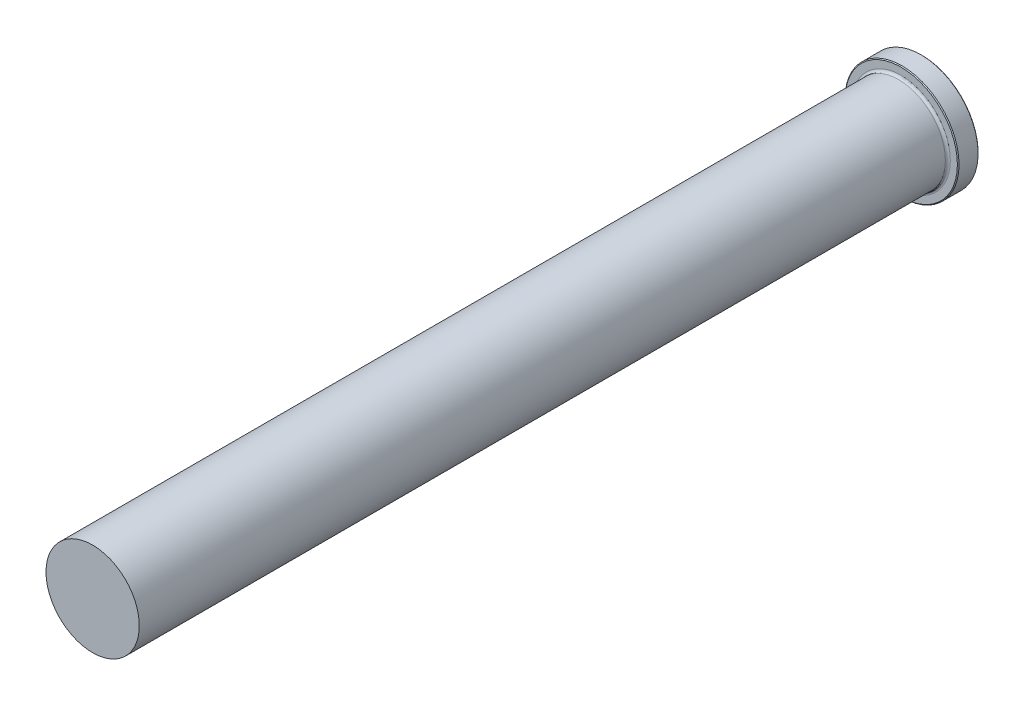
from build123d import *

# Parameters (mm, degrees)
FILLET1_R     = 0.762
CHAMFER1_SIZE = 0.254


with BuildPart() as part:
    # Sketch1 → Revolve1 (revolve)
    with BuildSketch(Plane(origin=(0, 0, 0), x_dir=(0, 0, -1), z_dir=(1, 0, 0)), mode=Mode.PRIVATE) as revolve1_sk:
        Polygon((0, 0), (0, 17.4625), (-6.35, 17.4625), (-6.35, 14.2875), (-254, 14.2875), (-254, 0), align=None)
    revolve(revolve1_sk.sketch.rotate(Axis((0, 0, 0), (0, 0, 1)), 90), axis=Axis((0, 0, 0), (0, 0, 1)))

    # Fillet1
    fillet1_edges = [part.edges().sort_by_distance(p)[0] for p in [
        (14.2875, 0, 6.35),
    ]]
    fillet(fillet1_edges, radius=FILLET1_R)

    # Chamfer1
    chamfer1_edges = [part.edges().sort_by_distance(p)[0] for p in [
        (17.4625, 0, 6.35),
        (17.4625, 0, 0),
    ]]
    chamfer(chamfer1_edges, length=CHAMFER1_SIZE)


solid = part.part
